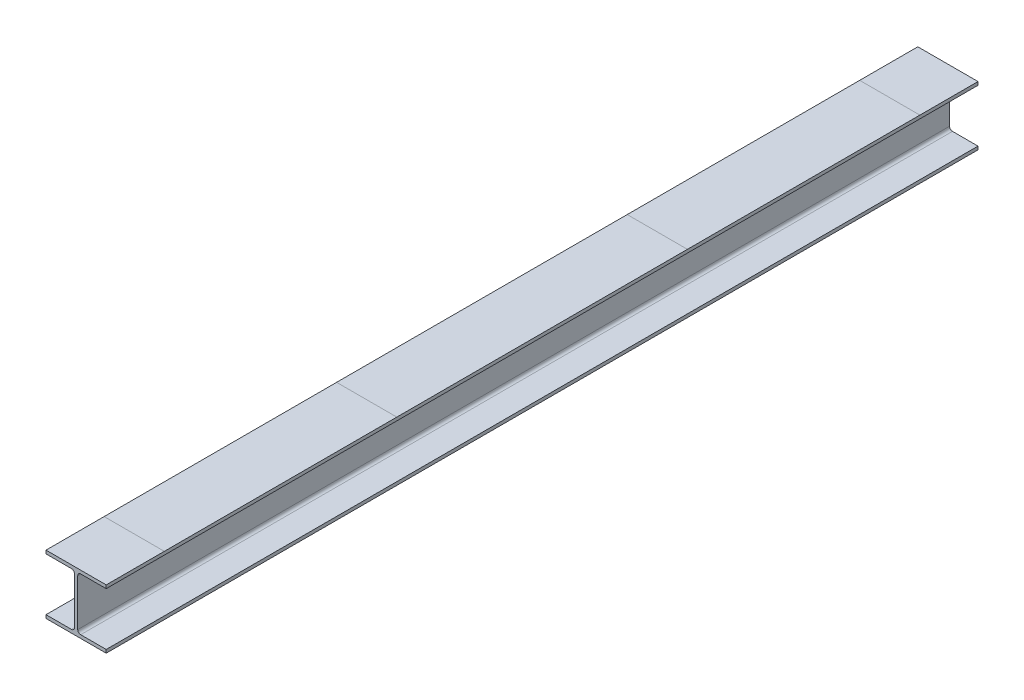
ISO-10303-21;
HEADER;
FILE_DESCRIPTION(('STEP AP214'),'2;1');
FILE_NAME('part.step','',(''),(''),'','','');
FILE_SCHEMA(('AUTOMOTIVE_DESIGN { 1 0 10303 214 1 1 1 1 }'));
ENDSEC;
DATA;
#1=APPLICATION_CONTEXT('core data for automotive mechanical design processes');
#2=APPLICATION_PROTOCOL_DEFINITION('international standard','automotive_design',2000,#1);
#3=PRODUCT_CONTEXT('',#1,'mechanical');
#4=PRODUCT('Part','Part','',(#3));
#5=PRODUCT_RELATED_PRODUCT_CATEGORY('part','',(#4));
#6=PRODUCT_DEFINITION_FORMATION('','',#4);
#7=PRODUCT_DEFINITION_CONTEXT('part definition',#1,'design');
#8=PRODUCT_DEFINITION('design','',#6,#7);
#9=PRODUCT_DEFINITION_SHAPE('','',#8);
#10=(LENGTH_UNIT() NAMED_UNIT(*) SI_UNIT(.MILLI.,.METRE.));
#11=(NAMED_UNIT(*) PLANE_ANGLE_UNIT() SI_UNIT($,.RADIAN.));
#12=(NAMED_UNIT(*) SI_UNIT($,.STERADIAN.) SOLID_ANGLE_UNIT());
#13=UNCERTAINTY_MEASURE_WITH_UNIT(LENGTH_MEASURE(1.E-05),#10,'distance_accuracy_value','');
#14=(GEOMETRIC_REPRESENTATION_CONTEXT(3) GLOBAL_UNCERTAINTY_ASSIGNED_CONTEXT((#13)) GLOBAL_UNIT_ASSIGNED_CONTEXT((#10,
#11,#12)) REPRESENTATION_CONTEXT('',''));
#15=CARTESIAN_POINT('',(0.,0.,0.));
#16=DIRECTION('',(0.,0.,1.));
#17=DIRECTION('',(1.,0.,0.));
#18=AXIS2_PLACEMENT_3D('',#15,#16,#17);
#19=CARTESIAN_POINT('',(-81.2800000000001,194.945,3000.));
#20=DIRECTION('',(0.,-1.,0.));
#21=DIRECTION('',(0.,0.,-1.));
#22=AXIS2_PLACEMENT_3D('',#19,#20,#21);
#23=PLANE('',#22);
#24=DIRECTION('',(-1.,0.,0.));
#25=VECTOR('',#24,1.);
#26=CARTESIAN_POINT('',(-81.2800000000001,194.945,2800.));
#27=LINE('',#26,#25);
#28=CARTESIAN_POINT('',(125.857,194.945,2800.));
#29=VERTEX_POINT('',#28);
#30=CARTESIAN_POINT('',(-81.2800000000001,194.945,2800.));
#31=VERTEX_POINT('',#30);
#32=EDGE_CURVE('E11',#29,#31,#27,.T.);
#33=ORIENTED_EDGE('',*,*,#32,.F.);
#34=DIRECTION('',(0.,0.,-1.));
#35=VECTOR('',#34,1.);
#36=CARTESIAN_POINT('',(125.857,194.945,3000.));
#37=LINE('',#36,#35);
#38=CARTESIAN_POINT('',(125.857,194.945,2000.));
#39=VERTEX_POINT('',#38);
#40=EDGE_CURVE('E237',#29,#39,#37,.T.);
#41=ORIENTED_EDGE('',*,*,#40,.T.);
#42=DIRECTION('',(1.,0.,0.));
#43=VECTOR('',#42,1.);
#44=CARTESIAN_POINT('',(-81.2800000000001,194.945,2000.));
#45=LINE('',#44,#43);
#46=CARTESIAN_POINT('',(-81.2800000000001,194.945,2000.));
#47=VERTEX_POINT('',#46);
#48=EDGE_CURVE('E206',#47,#39,#45,.T.);
#49=ORIENTED_EDGE('',*,*,#48,.F.);
#50=DIRECTION('',(0.,0.,-1.));
#51=VECTOR('',#50,1.);
#52=CARTESIAN_POINT('',(-81.2800000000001,194.945,3000.));
#53=LINE('',#52,#51);
#54=EDGE_CURVE('E243',#31,#47,#53,.T.);
#55=ORIENTED_EDGE('',*,*,#54,.F.);
#56=EDGE_LOOP('',(#33,#41,#49,#55));
#57=FACE_BOUND('',#56,.T.);
#58=ADVANCED_FACE('F34',(#57),#23,.F.);
#59=CARTESIAN_POINT('',(125.857,-8.76299999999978,3000.));
#60=DIRECTION('',(0.,1.,0.));
#61=DIRECTION('',(-1.,0.,0.));
#62=AXIS2_PLACEMENT_3D('',#59,#60,#61);
#63=PLANE('',#62);
#64=DIRECTION('',(1.,0.,0.));
#65=VECTOR('',#64,1.);
#66=CARTESIAN_POINT('',(125.857,-8.76299999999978,1000.));
#67=LINE('',#66,#65);
#68=CARTESIAN_POINT('',(-81.2800000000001,-8.76299999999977,1000.));
#69=VERTEX_POINT('',#68);
#70=CARTESIAN_POINT('',(125.857,-8.76299999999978,1000.));
#71=VERTEX_POINT('',#70);
#72=EDGE_CURVE('E43',#69,#71,#67,.T.);
#73=ORIENTED_EDGE('',*,*,#72,.F.);
#74=DIRECTION('',(0.,0.,-1.));
#75=VECTOR('',#74,1.);
#76=CARTESIAN_POINT('',(-81.2800000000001,-8.76299999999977,3000.));
#77=LINE('',#76,#75);
#78=CARTESIAN_POINT('',(-81.2800000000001,-8.76299999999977,0.));
#79=VERTEX_POINT('',#78);
#80=EDGE_CURVE('E267',#69,#79,#77,.T.);
#81=ORIENTED_EDGE('',*,*,#80,.T.);
#82=DIRECTION('',(1.,0.,0.));
#83=VECTOR('',#82,1.);
#84=CARTESIAN_POINT('',(125.857,-8.76299999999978,0.));
#85=LINE('',#84,#83);
#86=CARTESIAN_POINT('',(125.857,-8.76299999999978,0.));
#87=VERTEX_POINT('',#86);
#88=EDGE_CURVE('E300',#79,#87,#85,.T.);
#89=ORIENTED_EDGE('',*,*,#88,.T.);
#90=DIRECTION('',(0.,0.,-1.));
#91=VECTOR('',#90,1.);
#92=CARTESIAN_POINT('',(125.857,-8.76299999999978,3000.));
#93=LINE('',#92,#91);
#94=EDGE_CURVE('E209',#71,#87,#93,.T.);
#95=ORIENTED_EDGE('',*,*,#94,.F.);
#96=EDGE_LOOP('',(#73,#81,#89,#95));
#97=FACE_BOUND('',#96,.T.);
#98=ADVANCED_FACE('F395',(#97),#63,.F.);
#99=DIRECTION('',(-1.,0.,0.));
#100=VECTOR('',#99,1.);
#101=CARTESIAN_POINT('',(125.857,-8.76299999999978,2000.));
#102=LINE('',#101,#100);
#103=CARTESIAN_POINT('',(125.857,-8.76299999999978,2000.));
#104=VERTEX_POINT('',#103);
#105=CARTESIAN_POINT('',(-81.2800000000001,-8.76299999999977,2000.));
#106=VERTEX_POINT('',#105);
#107=EDGE_CURVE('E204',#104,#106,#102,.T.);
#108=ORIENTED_EDGE('',*,*,#107,.F.);
#109=CARTESIAN_POINT('',(125.857,-8.76299999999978,3000.));
#110=VERTEX_POINT('',#109);
#111=EDGE_CURVE('E186',#110,#104,#93,.T.);
#112=ORIENTED_EDGE('',*,*,#111,.F.);
#113=DIRECTION('',(1.,0.,0.));
#114=VECTOR('',#113,1.);
#115=CARTESIAN_POINT('',(125.857,-8.76299999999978,3000.));
#116=LINE('',#115,#114);
#117=CARTESIAN_POINT('',(-81.2800000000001,-8.76299999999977,3000.));
#118=VERTEX_POINT('',#117);
#119=EDGE_CURVE('E192',#118,#110,#116,.T.);
#120=ORIENTED_EDGE('',*,*,#119,.F.);
#121=EDGE_CURVE('E264',#118,#106,#77,.T.);
#122=ORIENTED_EDGE('',*,*,#121,.T.);
#123=EDGE_LOOP('',(#108,#112,#120,#122));
#124=FACE_BOUND('',#123,.T.);
#125=ADVANCED_FACE('F203',(#124),#63,.F.);
#126=DIRECTION('',(1.,0.,0.));
#127=VECTOR('',#126,1.);
#128=CARTESIAN_POINT('',(-81.2800000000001,194.945,200.));
#129=LINE('',#128,#127);
#130=CARTESIAN_POINT('',(-81.2800000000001,194.945,200.));
#131=VERTEX_POINT('',#130);
#132=CARTESIAN_POINT('',(125.857,194.945,200.));
#133=VERTEX_POINT('',#132);
#134=EDGE_CURVE('E410',#131,#133,#129,.T.);
#135=ORIENTED_EDGE('',*,*,#134,.F.);
#136=CARTESIAN_POINT('',(-81.2800000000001,194.945,1000.));
#137=VERTEX_POINT('',#136);
#138=EDGE_CURVE('E418',#137,#131,#53,.T.);
#139=ORIENTED_EDGE('',*,*,#138,.F.);
#140=DIRECTION('',(-1.,0.,0.));
#141=VECTOR('',#140,1.);
#142=CARTESIAN_POINT('',(-81.2800000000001,194.945,1000.));
#143=LINE('',#142,#141);
#144=CARTESIAN_POINT('',(125.857,194.945,1000.));
#145=VERTEX_POINT('',#144);
#146=EDGE_CURVE('E212',#145,#137,#143,.T.);
#147=ORIENTED_EDGE('',*,*,#146,.F.);
#148=EDGE_CURVE('E404',#145,#133,#37,.T.);
#149=ORIENTED_EDGE('',*,*,#148,.T.);
#150=EDGE_LOOP('',(#135,#139,#147,#149));
#151=FACE_BOUND('',#150,.T.);
#152=ADVANCED_FACE('F408',(#151),#23,.F.);
#153=CARTESIAN_POINT('',(-81.2800000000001,194.945,0.));
#154=VERTEX_POINT('',#153);
#155=EDGE_CURVE('E248',#131,#154,#53,.T.);
#156=ORIENTED_EDGE('',*,*,#155,.F.);
#157=ORIENTED_EDGE('',*,*,#134,.T.);
#158=CARTESIAN_POINT('',(125.857,194.945,0.));
#159=VERTEX_POINT('',#158);
#160=EDGE_CURVE('E242',#133,#159,#37,.T.);
#161=ORIENTED_EDGE('',*,*,#160,.T.);
#162=DIRECTION('',(-1.,0.,0.));
#163=VECTOR('',#162,1.);
#164=CARTESIAN_POINT('',(-81.2800000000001,194.945,0.));
#165=LINE('',#164,#163);
#166=EDGE_CURVE('E282',#159,#154,#165,.T.);
#167=ORIENTED_EDGE('',*,*,#166,.T.);
#168=EDGE_LOOP('',(#156,#157,#161,#167));
#169=FACE_BOUND('',#168,.T.);
#170=ADVANCED_FACE('F419',(#169),#23,.F.);
#171=CARTESIAN_POINT('',(125.857,194.945,3000.));
#172=VERTEX_POINT('',#171);
#173=EDGE_CURVE('E235',#172,#29,#37,.T.);
#174=ORIENTED_EDGE('',*,*,#173,.T.);
#175=ORIENTED_EDGE('',*,*,#32,.T.);
#176=CARTESIAN_POINT('',(-81.2800000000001,194.945,3000.));
#177=VERTEX_POINT('',#176);
#178=EDGE_CURVE('E239',#177,#31,#53,.T.);
#179=ORIENTED_EDGE('',*,*,#178,.F.);
#180=DIRECTION('',(-1.,0.,0.));
#181=VECTOR('',#180,1.);
#182=CARTESIAN_POINT('',(-81.2800000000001,194.945,3000.));
#183=LINE('',#182,#181);
#184=EDGE_CURVE('E316',#172,#177,#183,.T.);
#185=ORIENTED_EDGE('',*,*,#184,.F.);
#186=EDGE_LOOP('',(#174,#175,#179,#185));
#187=FACE_BOUND('',#186,.T.);
#188=ADVANCED_FACE('F358',(#187),#23,.F.);
#189=EDGE_CURVE('E266',#106,#69,#77,.T.);
#190=ORIENTED_EDGE('',*,*,#189,.T.);
#191=ORIENTED_EDGE('',*,*,#72,.T.);
#192=EDGE_CURVE('E207',#104,#71,#93,.T.);
#193=ORIENTED_EDGE('',*,*,#192,.F.);
#194=ORIENTED_EDGE('',*,*,#107,.T.);
#195=EDGE_LOOP('',(#190,#191,#193,#194));
#196=FACE_BOUND('',#195,.T.);
#197=ADVANCED_FACE('F36',(#196),#63,.F.);
#198=CARTESIAN_POINT('',(125.857,2.54000000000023,3000.));
#199=DIRECTION('',(-1.,0.,0.));
#200=DIRECTION('',(0.,-1.,0.));
#201=AXIS2_PLACEMENT_3D('',#198,#199,#200);
#202=PLANE('',#201);
#203=DIRECTION('',(0.,1.,0.));
#204=VECTOR('',#203,1.);
#205=CARTESIAN_POINT('',(125.857,2.54000000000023,0.));
#206=LINE('',#205,#204);
#207=CARTESIAN_POINT('',(125.857,2.54000000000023,0.));
#208=VERTEX_POINT('',#207);
#209=EDGE_CURVE('E298',#87,#208,#206,.T.);
#210=ORIENTED_EDGE('',*,*,#209,.T.);
#211=DIRECTION('',(0.,0.,-1.));
#212=VECTOR('',#211,1.);
#213=CARTESIAN_POINT('',(125.857,2.54000000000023,3000.));
#214=LINE('',#213,#212);
#215=CARTESIAN_POINT('',(125.857,2.54000000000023,3000.));
#216=VERTEX_POINT('',#215);
#217=EDGE_CURVE('E188',#216,#208,#214,.T.);
#218=ORIENTED_EDGE('',*,*,#217,.F.);
#219=DIRECTION('',(0.,1.,0.));
#220=VECTOR('',#219,1.);
#221=CARTESIAN_POINT('',(125.857,2.54000000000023,3000.));
#222=LINE('',#221,#220);
#223=EDGE_CURVE('E181',#110,#216,#222,.T.);
#224=ORIENTED_EDGE('',*,*,#223,.F.);
#225=ORIENTED_EDGE('',*,*,#111,.T.);
#226=ORIENTED_EDGE('',*,*,#192,.T.);
#227=ORIENTED_EDGE('',*,*,#94,.T.);
#228=EDGE_LOOP('',(#210,#218,#224,#225,#226,#227));
#229=FACE_BOUND('',#228,.T.);
#230=ADVANCED_FACE('F183',(#229),#202,.F.);
#231=CARTESIAN_POINT('',(38.0999999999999,2.54000000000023,3000.));
#232=DIRECTION('',(0.,-1.,0.));
#233=DIRECTION('',(0.,0.,-1.));
#234=AXIS2_PLACEMENT_3D('',#231,#232,#233);
#235=PLANE('',#234);
#236=DIRECTION('',(-1.,0.,0.));
#237=VECTOR('',#236,1.);
#238=CARTESIAN_POINT('',(38.0999999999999,2.54000000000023,0.));
#239=LINE('',#238,#237);
#240=CARTESIAN_POINT('',(38.0999999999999,2.54000000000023,0.));
#241=VERTEX_POINT('',#240);
#242=EDGE_CURVE('E296',#208,#241,#239,.T.);
#243=ORIENTED_EDGE('',*,*,#242,.T.);
#244=DIRECTION('',(0.,0.,-1.));
#245=VECTOR('',#244,1.);
#246=CARTESIAN_POINT('',(38.0999999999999,2.54000000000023,3000.));
#247=LINE('',#246,#245);
#248=CARTESIAN_POINT('',(38.0999999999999,2.54000000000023,3000.));
#249=VERTEX_POINT('',#248);
#250=EDGE_CURVE('E217',#249,#241,#247,.T.);
#251=ORIENTED_EDGE('',*,*,#250,.F.);
#252=DIRECTION('',(-1.,0.,0.));
#253=VECTOR('',#252,1.);
#254=CARTESIAN_POINT('',(38.0999999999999,2.54000000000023,3000.));
#255=LINE('',#254,#253);
#256=EDGE_CURVE('E191',#216,#249,#255,.T.);
#257=ORIENTED_EDGE('',*,*,#256,.F.);
#258=ORIENTED_EDGE('',*,*,#217,.T.);
#259=EDGE_LOOP('',(#243,#251,#257,#258));
#260=FACE_BOUND('',#259,.T.);
#261=ADVANCED_FACE('F331',(#260),#235,.F.);
#262=CARTESIAN_POINT('',(38.0999999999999,12.7000000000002,3000.));
#263=DIRECTION('',(0.,0.,-1.));
#264=DIRECTION('',(-1.,0.,0.));
#265=AXIS2_PLACEMENT_3D('',#262,#263,#264);
#266=CYLINDRICAL_SURFACE('',#265,10.16);
#267=CARTESIAN_POINT('',(38.0999999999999,12.7000000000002,0.));
#268=DIRECTION('',(0.,0.,-1.));
#269=DIRECTION('',(1.,0.,0.));
#270=AXIS2_PLACEMENT_3D('',#267,#268,#269);
#271=CIRCLE('',#270,10.16);
#272=CARTESIAN_POINT('',(27.9399999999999,12.7000000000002,0.));
#273=VERTEX_POINT('',#272);
#274=EDGE_CURVE('E294',#241,#273,#271,.T.);
#275=ORIENTED_EDGE('',*,*,#274,.T.);
#276=DIRECTION('',(0.,0.,-1.));
#277=VECTOR('',#276,1.);
#278=CARTESIAN_POINT('',(27.9399999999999,12.7000000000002,3000.));
#279=LINE('',#278,#277);
#280=CARTESIAN_POINT('',(27.9399999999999,12.7000000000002,3000.));
#281=VERTEX_POINT('',#280);
#282=EDGE_CURVE('E221',#281,#273,#279,.T.);
#283=ORIENTED_EDGE('',*,*,#282,.F.);
#284=CARTESIAN_POINT('',(38.0999999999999,12.7000000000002,3000.));
#285=DIRECTION('',(0.,0.,-1.));
#286=DIRECTION('',(1.,0.,0.));
#287=AXIS2_PLACEMENT_3D('',#284,#285,#286);
#288=CIRCLE('',#287,10.16);
#289=EDGE_CURVE('E326',#249,#281,#288,.T.);
#290=ORIENTED_EDGE('',*,*,#289,.F.);
#291=ORIENTED_EDGE('',*,*,#250,.T.);
#292=EDGE_LOOP('',(#275,#283,#290,#291));
#293=FACE_BOUND('',#292,.T.);
#294=ADVANCED_FACE('F334',(#293),#266,.F.);
#295=CARTESIAN_POINT('',(27.9399999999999,173.482,3000.));
#296=DIRECTION('',(-1.,0.,0.));
#297=DIRECTION('',(0.,-1.,0.));
#298=AXIS2_PLACEMENT_3D('',#295,#296,#297);
#299=PLANE('',#298);
#300=DIRECTION('',(0.,1.,0.));
#301=VECTOR('',#300,1.);
#302=CARTESIAN_POINT('',(27.9399999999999,173.482,0.));
#303=LINE('',#302,#301);
#304=CARTESIAN_POINT('',(27.9399999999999,173.482,0.));
#305=VERTEX_POINT('',#304);
#306=EDGE_CURVE('E292',#273,#305,#303,.T.);
#307=ORIENTED_EDGE('',*,*,#306,.T.);
#308=DIRECTION('',(0.,0.,-1.));
#309=VECTOR('',#308,1.);
#310=CARTESIAN_POINT('',(27.9399999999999,173.482,3000.));
#311=LINE('',#310,#309);
#312=CARTESIAN_POINT('',(27.9399999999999,173.482,3000.));
#313=VERTEX_POINT('',#312);
#314=EDGE_CURVE('E226',#313,#305,#311,.T.);
#315=ORIENTED_EDGE('',*,*,#314,.F.);
#316=DIRECTION('',(0.,1.,0.));
#317=VECTOR('',#316,1.);
#318=CARTESIAN_POINT('',(27.9399999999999,173.482,3000.));
#319=LINE('',#318,#317);
#320=EDGE_CURVE('E324',#281,#313,#319,.T.);
#321=ORIENTED_EDGE('',*,*,#320,.F.);
#322=ORIENTED_EDGE('',*,*,#282,.T.);
#323=EDGE_LOOP('',(#307,#315,#321,#322));
#324=FACE_BOUND('',#323,.T.);
#325=ADVANCED_FACE('F339',(#324),#299,.F.);
#326=CARTESIAN_POINT('',(38.0999999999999,173.482,3000.));
#327=DIRECTION('',(0.,0.,-1.));
#328=DIRECTION('',(-1.,0.,0.));
#329=AXIS2_PLACEMENT_3D('',#326,#327,#328);
#330=CYLINDRICAL_SURFACE('',#329,10.16);
#331=CARTESIAN_POINT('',(38.0999999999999,173.482,0.));
#332=DIRECTION('',(0.,0.,-1.));
#333=DIRECTION('',(1.,0.,0.));
#334=AXIS2_PLACEMENT_3D('',#331,#332,#333);
#335=CIRCLE('',#334,10.16);
#336=CARTESIAN_POINT('',(38.0999999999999,183.642,0.));
#337=VERTEX_POINT('',#336);
#338=EDGE_CURVE('E290',#305,#337,#335,.T.);
#339=ORIENTED_EDGE('',*,*,#338,.T.);
#340=DIRECTION('',(0.,0.,-1.));
#341=VECTOR('',#340,1.);
#342=CARTESIAN_POINT('',(38.0999999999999,183.642,3000.));
#343=LINE('',#342,#341);
#344=CARTESIAN_POINT('',(38.0999999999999,183.642,3000.));
#345=VERTEX_POINT('',#344);
#346=EDGE_CURVE('E229',#345,#337,#343,.T.);
#347=ORIENTED_EDGE('',*,*,#346,.F.);
#348=CARTESIAN_POINT('',(38.0999999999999,173.482,3000.));
#349=DIRECTION('',(0.,0.,-1.));
#350=DIRECTION('',(1.,0.,0.));
#351=AXIS2_PLACEMENT_3D('',#348,#349,#350);
#352=CIRCLE('',#351,10.16);
#353=EDGE_CURVE('E322',#313,#345,#352,.T.);
#354=ORIENTED_EDGE('',*,*,#353,.F.);
#355=ORIENTED_EDGE('',*,*,#314,.T.);
#356=EDGE_LOOP('',(#339,#347,#354,#355));
#357=FACE_BOUND('',#356,.T.);
#358=ADVANCED_FACE('F345',(#357),#330,.F.);
#359=CARTESIAN_POINT('',(125.857,183.642,3000.));
#360=DIRECTION('',(0.,1.,0.));
#361=DIRECTION('',(0.,0.,1.));
#362=AXIS2_PLACEMENT_3D('',#359,#360,#361);
#363=PLANE('',#362);
#364=DIRECTION('',(1.,0.,0.));
#365=VECTOR('',#364,1.);
#366=CARTESIAN_POINT('',(125.857,183.642,0.));
#367=LINE('',#366,#365);
#368=CARTESIAN_POINT('',(125.857,183.642,0.));
#369=VERTEX_POINT('',#368);
#370=EDGE_CURVE('E288',#337,#369,#367,.T.);
#371=ORIENTED_EDGE('',*,*,#370,.T.);
#372=DIRECTION('',(0.,0.,-1.));
#373=VECTOR('',#372,1.);
#374=CARTESIAN_POINT('',(125.857,183.642,3000.));
#375=LINE('',#374,#373);
#376=CARTESIAN_POINT('',(125.857,183.642,3000.));
#377=VERTEX_POINT('',#376);
#378=EDGE_CURVE('E232',#377,#369,#375,.T.);
#379=ORIENTED_EDGE('',*,*,#378,.F.);
#380=DIRECTION('',(1.,0.,0.));
#381=VECTOR('',#380,1.);
#382=CARTESIAN_POINT('',(125.857,183.642,3000.));
#383=LINE('',#382,#381);
#384=EDGE_CURVE('E320',#345,#377,#383,.T.);
#385=ORIENTED_EDGE('',*,*,#384,.F.);
#386=ORIENTED_EDGE('',*,*,#346,.T.);
#387=EDGE_LOOP('',(#371,#379,#385,#386));
#388=FACE_BOUND('',#387,.T.);
#389=ADVANCED_FACE('F349',(#388),#363,.F.);
#390=CARTESIAN_POINT('',(125.857,194.945,3000.));
#391=DIRECTION('',(-1.,0.,0.));
#392=DIRECTION('',(0.,-1.,0.));
#393=AXIS2_PLACEMENT_3D('',#390,#391,#392);
#394=PLANE('',#393);
#395=DIRECTION('',(0.,1.,0.));
#396=VECTOR('',#395,1.);
#397=CARTESIAN_POINT('',(125.857,194.945,0.));
#398=LINE('',#397,#396);
#399=EDGE_CURVE('E285',#369,#159,#398,.T.);
#400=ORIENTED_EDGE('',*,*,#399,.T.);
#401=ORIENTED_EDGE('',*,*,#160,.F.);
#402=ORIENTED_EDGE('',*,*,#148,.F.);
#403=EDGE_CURVE('E238',#39,#145,#37,.T.);
#404=ORIENTED_EDGE('',*,*,#403,.F.);
#405=ORIENTED_EDGE('',*,*,#40,.F.);
#406=ORIENTED_EDGE('',*,*,#173,.F.);
#407=DIRECTION('',(0.,1.,0.));
#408=VECTOR('',#407,1.);
#409=CARTESIAN_POINT('',(125.857,194.945,3000.));
#410=LINE('',#409,#408);
#411=EDGE_CURVE('E318',#377,#172,#410,.T.);
#412=ORIENTED_EDGE('',*,*,#411,.F.);
#413=ORIENTED_EDGE('',*,*,#378,.T.);
#414=EDGE_LOOP('',(#400,#401,#402,#404,#405,#406,#412,#413));
#415=FACE_BOUND('',#414,.T.);
#416=ADVANCED_FACE('F354',(#415),#394,.F.);
#417=ORIENTED_EDGE('',*,*,#403,.T.);
#418=ORIENTED_EDGE('',*,*,#146,.T.);
#419=EDGE_CURVE('E244',#47,#137,#53,.T.);
#420=ORIENTED_EDGE('',*,*,#419,.F.);
#421=ORIENTED_EDGE('',*,*,#48,.T.);
#422=EDGE_LOOP('',(#417,#418,#420,#421));
#423=FACE_BOUND('',#422,.T.);
#424=ADVANCED_FACE('F415',(#423),#23,.F.);
#425=CARTESIAN_POINT('',(-81.2800000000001,183.642,3000.));
#426=DIRECTION('',(1.,0.,0.));
#427=DIRECTION('',(0.,0.,-1.));
#428=AXIS2_PLACEMENT_3D('',#425,#426,#427);
#429=PLANE('',#428);
#430=DIRECTION('',(0.,-1.,0.));
#431=VECTOR('',#430,1.);
#432=CARTESIAN_POINT('',(-81.2800000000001,183.642,0.));
#433=LINE('',#432,#431);
#434=CARTESIAN_POINT('',(-81.2800000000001,183.642,0.));
#435=VERTEX_POINT('',#434);
#436=EDGE_CURVE('E280',#154,#435,#433,.T.);
#437=ORIENTED_EDGE('',*,*,#436,.T.);
#438=DIRECTION('',(0.,0.,-1.));
#439=VECTOR('',#438,1.);
#440=CARTESIAN_POINT('',(-81.2800000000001,183.642,3000.));
#441=LINE('',#440,#439);
#442=CARTESIAN_POINT('',(-81.2800000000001,183.642,3000.));
#443=VERTEX_POINT('',#442);
#444=EDGE_CURVE('E245',#443,#435,#441,.T.);
#445=ORIENTED_EDGE('',*,*,#444,.F.);
#446=DIRECTION('',(0.,-1.,0.));
#447=VECTOR('',#446,1.);
#448=CARTESIAN_POINT('',(-81.2800000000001,183.642,3000.));
#449=LINE('',#448,#447);
#450=EDGE_CURVE('E314',#177,#443,#449,.T.);
#451=ORIENTED_EDGE('',*,*,#450,.F.);
#452=ORIENTED_EDGE('',*,*,#178,.T.);
#453=ORIENTED_EDGE('',*,*,#54,.T.);
#454=ORIENTED_EDGE('',*,*,#419,.T.);
#455=ORIENTED_EDGE('',*,*,#138,.T.);
#456=ORIENTED_EDGE('',*,*,#155,.T.);
#457=EDGE_LOOP('',(#437,#445,#451,#452,#453,#454,#455,#456));
#458=FACE_BOUND('',#457,.T.);
#459=ADVANCED_FACE('F360',(#458),#429,.F.);
#460=CARTESIAN_POINT('',(6.47699999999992,183.642,3000.));
#461=DIRECTION('',(0.,1.,0.));
#462=DIRECTION('',(0.,0.,1.));
#463=AXIS2_PLACEMENT_3D('',#460,#461,#462);
#464=PLANE('',#463);
#465=DIRECTION('',(1.,0.,0.));
#466=VECTOR('',#465,1.);
#467=CARTESIAN_POINT('',(6.47699999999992,183.642,0.));
#468=LINE('',#467,#466);
#469=CARTESIAN_POINT('',(6.47699999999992,183.642,0.));
#470=VERTEX_POINT('',#469);
#471=EDGE_CURVE('E278',#435,#470,#468,.T.);
#472=ORIENTED_EDGE('',*,*,#471,.T.);
#473=DIRECTION('',(0.,0.,-1.));
#474=VECTOR('',#473,1.);
#475=CARTESIAN_POINT('',(6.47699999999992,183.642,3000.));
#476=LINE('',#475,#474);
#477=CARTESIAN_POINT('',(6.47699999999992,183.642,3000.));
#478=VERTEX_POINT('',#477);
#479=EDGE_CURVE('E249',#478,#470,#476,.T.);
#480=ORIENTED_EDGE('',*,*,#479,.F.);
#481=DIRECTION('',(1.,0.,0.));
#482=VECTOR('',#481,1.);
#483=CARTESIAN_POINT('',(6.47699999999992,183.642,3000.));
#484=LINE('',#483,#482);
#485=EDGE_CURVE('E312',#443,#478,#484,.T.);
#486=ORIENTED_EDGE('',*,*,#485,.F.);
#487=ORIENTED_EDGE('',*,*,#444,.T.);
#488=EDGE_LOOP('',(#472,#480,#486,#487));
#489=FACE_BOUND('',#488,.T.);
#490=ADVANCED_FACE('F366',(#489),#464,.F.);
#491=CARTESIAN_POINT('',(6.47699999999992,173.482,3000.));
#492=DIRECTION('',(0.,0.,-1.));
#493=DIRECTION('',(-1.,0.,0.));
#494=AXIS2_PLACEMENT_3D('',#491,#492,#493);
#495=CYLINDRICAL_SURFACE('',#494,10.16);
#496=CARTESIAN_POINT('',(6.47699999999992,173.482,0.));
#497=DIRECTION('',(0.,0.,-1.));
#498=DIRECTION('',(1.,0.,0.));
#499=AXIS2_PLACEMENT_3D('',#496,#497,#498);
#500=CIRCLE('',#499,10.16);
#501=CARTESIAN_POINT('',(16.6369999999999,173.482,0.));
#502=VERTEX_POINT('',#501);
#503=EDGE_CURVE('E276',#470,#502,#500,.T.);
#504=ORIENTED_EDGE('',*,*,#503,.T.);
#505=DIRECTION('',(0.,0.,-1.));
#506=VECTOR('',#505,1.);
#507=CARTESIAN_POINT('',(16.6369999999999,173.482,3000.));
#508=LINE('',#507,#506);
#509=CARTESIAN_POINT('',(16.6369999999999,173.482,3000.));
#510=VERTEX_POINT('',#509);
#511=EDGE_CURVE('E252',#510,#502,#508,.T.);
#512=ORIENTED_EDGE('',*,*,#511,.F.);
#513=CARTESIAN_POINT('',(6.47699999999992,173.482,3000.));
#514=DIRECTION('',(0.,0.,-1.));
#515=DIRECTION('',(1.,0.,0.));
#516=AXIS2_PLACEMENT_3D('',#513,#514,#515);
#517=CIRCLE('',#516,10.16);
#518=EDGE_CURVE('E310',#478,#510,#517,.T.);
#519=ORIENTED_EDGE('',*,*,#518,.F.);
#520=ORIENTED_EDGE('',*,*,#479,.T.);
#521=EDGE_LOOP('',(#504,#512,#519,#520));
#522=FACE_BOUND('',#521,.T.);
#523=ADVANCED_FACE('F372',(#522),#495,.F.);
#524=CARTESIAN_POINT('',(16.6369999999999,12.7000000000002,3000.));
#525=DIRECTION('',(1.,0.,0.));
#526=DIRECTION('',(0.,1.,0.));
#527=AXIS2_PLACEMENT_3D('',#524,#525,#526);
#528=PLANE('',#527);
#529=DIRECTION('',(0.,-1.,0.));
#530=VECTOR('',#529,1.);
#531=CARTESIAN_POINT('',(16.6369999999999,12.7000000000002,0.));
#532=LINE('',#531,#530);
#533=CARTESIAN_POINT('',(16.6369999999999,12.7000000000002,0.));
#534=VERTEX_POINT('',#533);
#535=EDGE_CURVE('E274',#502,#534,#532,.T.);
#536=ORIENTED_EDGE('',*,*,#535,.T.);
#537=DIRECTION('',(0.,0.,-1.));
#538=VECTOR('',#537,1.);
#539=CARTESIAN_POINT('',(16.6369999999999,12.7000000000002,3000.));
#540=LINE('',#539,#538);
#541=CARTESIAN_POINT('',(16.6369999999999,12.7000000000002,3000.));
#542=VERTEX_POINT('',#541);
#543=EDGE_CURVE('E255',#542,#534,#540,.T.);
#544=ORIENTED_EDGE('',*,*,#543,.F.);
#545=DIRECTION('',(0.,-1.,0.));
#546=VECTOR('',#545,1.);
#547=CARTESIAN_POINT('',(16.6369999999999,12.7000000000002,3000.));
#548=LINE('',#547,#546);
#549=EDGE_CURVE('E308',#510,#542,#548,.T.);
#550=ORIENTED_EDGE('',*,*,#549,.F.);
#551=ORIENTED_EDGE('',*,*,#511,.T.);
#552=EDGE_LOOP('',(#536,#544,#550,#551));
#553=FACE_BOUND('',#552,.T.);
#554=ADVANCED_FACE('F376',(#553),#528,.F.);
#555=CARTESIAN_POINT('',(6.47699999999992,12.7000000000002,3000.));
#556=DIRECTION('',(0.,0.,-1.));
#557=DIRECTION('',(-1.,0.,0.));
#558=AXIS2_PLACEMENT_3D('',#555,#556,#557);
#559=CYLINDRICAL_SURFACE('',#558,10.16);
#560=CARTESIAN_POINT('',(6.47699999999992,12.7000000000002,0.));
#561=DIRECTION('',(0.,0.,-1.));
#562=DIRECTION('',(1.,0.,0.));
#563=AXIS2_PLACEMENT_3D('',#560,#561,#562);
#564=CIRCLE('',#563,10.16);
#565=CARTESIAN_POINT('',(6.47699999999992,2.54000000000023,0.));
#566=VERTEX_POINT('',#565);
#567=EDGE_CURVE('E272',#534,#566,#564,.T.);
#568=ORIENTED_EDGE('',*,*,#567,.T.);
#569=DIRECTION('',(0.,0.,-1.));
#570=VECTOR('',#569,1.);
#571=CARTESIAN_POINT('',(6.47699999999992,2.54000000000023,3000.));
#572=LINE('',#571,#570);
#573=CARTESIAN_POINT('',(6.47699999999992,2.54000000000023,3000.));
#574=VERTEX_POINT('',#573);
#575=EDGE_CURVE('E258',#574,#566,#572,.T.);
#576=ORIENTED_EDGE('',*,*,#575,.F.);
#577=CARTESIAN_POINT('',(6.47699999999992,12.7000000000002,3000.));
#578=DIRECTION('',(0.,0.,-1.));
#579=DIRECTION('',(1.,0.,0.));
#580=AXIS2_PLACEMENT_3D('',#577,#578,#579);
#581=CIRCLE('',#580,10.16);
#582=EDGE_CURVE('E306',#542,#574,#581,.T.);
#583=ORIENTED_EDGE('',*,*,#582,.F.);
#584=ORIENTED_EDGE('',*,*,#543,.T.);
#585=EDGE_LOOP('',(#568,#576,#583,#584));
#586=FACE_BOUND('',#585,.T.);
#587=ADVANCED_FACE('F381',(#586),#559,.F.);
#588=CARTESIAN_POINT('',(-81.2800000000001,2.54000000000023,3000.));
#589=DIRECTION('',(0.,-1.,0.));
#590=DIRECTION('',(1.,0.,0.));
#591=AXIS2_PLACEMENT_3D('',#588,#589,#590);
#592=PLANE('',#591);
#593=DIRECTION('',(-1.,0.,0.));
#594=VECTOR('',#593,1.);
#595=CARTESIAN_POINT('',(-81.2800000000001,2.54000000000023,0.));
#596=LINE('',#595,#594);
#597=CARTESIAN_POINT('',(-81.2800000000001,2.54000000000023,0.));
#598=VERTEX_POINT('',#597);
#599=EDGE_CURVE('E270',#566,#598,#596,.T.);
#600=ORIENTED_EDGE('',*,*,#599,.T.);
#601=DIRECTION('',(0.,0.,-1.));
#602=VECTOR('',#601,1.);
#603=CARTESIAN_POINT('',(-81.2800000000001,2.54000000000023,3000.));
#604=LINE('',#603,#602);
#605=CARTESIAN_POINT('',(-81.2800000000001,2.54000000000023,3000.));
#606=VERTEX_POINT('',#605);
#607=EDGE_CURVE('E261',#606,#598,#604,.T.);
#608=ORIENTED_EDGE('',*,*,#607,.F.);
#609=DIRECTION('',(-1.,0.,0.));
#610=VECTOR('',#609,1.);
#611=CARTESIAN_POINT('',(-81.2800000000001,2.54000000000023,3000.));
#612=LINE('',#611,#610);
#613=EDGE_CURVE('E304',#574,#606,#612,.T.);
#614=ORIENTED_EDGE('',*,*,#613,.F.);
#615=ORIENTED_EDGE('',*,*,#575,.T.);
#616=EDGE_LOOP('',(#600,#608,#614,#615));
#617=FACE_BOUND('',#616,.T.);
#618=ADVANCED_FACE('F385',(#617),#592,.F.);
#619=CARTESIAN_POINT('',(-81.2800000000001,-8.76299999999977,3000.));
#620=DIRECTION('',(1.,0.,0.));
#621=DIRECTION('',(0.,0.,-1.));
#622=AXIS2_PLACEMENT_3D('',#619,#620,#621);
#623=PLANE('',#622);
#624=DIRECTION('',(0.,-1.,0.));
#625=VECTOR('',#624,1.);
#626=CARTESIAN_POINT('',(-81.2800000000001,-8.76299999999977,0.));
#627=LINE('',#626,#625);
#628=EDGE_CURVE('E201',#598,#79,#627,.T.);
#629=ORIENTED_EDGE('',*,*,#628,.T.);
#630=ORIENTED_EDGE('',*,*,#80,.F.);
#631=ORIENTED_EDGE('',*,*,#189,.F.);
#632=ORIENTED_EDGE('',*,*,#121,.F.);
#633=DIRECTION('',(0.,-1.,0.));
#634=VECTOR('',#633,1.);
#635=CARTESIAN_POINT('',(-81.2800000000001,-8.76299999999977,3000.));
#636=LINE('',#635,#634);
#637=EDGE_CURVE('E197',#606,#118,#636,.T.);
#638=ORIENTED_EDGE('',*,*,#637,.F.);
#639=ORIENTED_EDGE('',*,*,#607,.T.);
#640=EDGE_LOOP('',(#629,#630,#631,#632,#638,#639));
#641=FACE_BOUND('',#640,.T.);
#642=ADVANCED_FACE('F389',(#641),#623,.F.);
#643=CARTESIAN_POINT('',(6.47699999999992,12.7000000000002,3000.));
#644=DIRECTION('',(0.,0.,1.));
#645=DIRECTION('',(1.,0.,0.));
#646=AXIS2_PLACEMENT_3D('',#643,#644,#645);
#647=PLANE('',#646);
#648=ORIENTED_EDGE('',*,*,#119,.T.);
#649=ORIENTED_EDGE('',*,*,#223,.T.);
#650=ORIENTED_EDGE('',*,*,#256,.T.);
#651=ORIENTED_EDGE('',*,*,#289,.T.);
#652=ORIENTED_EDGE('',*,*,#320,.T.);
#653=ORIENTED_EDGE('',*,*,#353,.T.);
#654=ORIENTED_EDGE('',*,*,#384,.T.);
#655=ORIENTED_EDGE('',*,*,#411,.T.);
#656=ORIENTED_EDGE('',*,*,#184,.T.);
#657=ORIENTED_EDGE('',*,*,#450,.T.);
#658=ORIENTED_EDGE('',*,*,#485,.T.);
#659=ORIENTED_EDGE('',*,*,#518,.T.);
#660=ORIENTED_EDGE('',*,*,#549,.T.);
#661=ORIENTED_EDGE('',*,*,#582,.T.);
#662=ORIENTED_EDGE('',*,*,#613,.T.);
#663=ORIENTED_EDGE('',*,*,#637,.T.);
#664=EDGE_LOOP('',(#648,#649,#650,#651,#652,#653,#654,#655,#656,#657,#658,#659,#660,#661,#662,#663));
#665=FACE_BOUND('',#664,.T.);
#666=ADVANCED_FACE('F195',(#665),#647,.T.);
#667=CARTESIAN_POINT('',(6.47699999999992,12.7000000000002,0.));
#668=DIRECTION('',(0.,0.,1.));
#669=DIRECTION('',(1.,0.,0.));
#670=AXIS2_PLACEMENT_3D('',#667,#668,#669);
#671=PLANE('',#670);
#672=ORIENTED_EDGE('',*,*,#88,.F.);
#673=ORIENTED_EDGE('',*,*,#628,.F.);
#674=ORIENTED_EDGE('',*,*,#599,.F.);
#675=ORIENTED_EDGE('',*,*,#567,.F.);
#676=ORIENTED_EDGE('',*,*,#535,.F.);
#677=ORIENTED_EDGE('',*,*,#503,.F.);
#678=ORIENTED_EDGE('',*,*,#471,.F.);
#679=ORIENTED_EDGE('',*,*,#436,.F.);
#680=ORIENTED_EDGE('',*,*,#166,.F.);
#681=ORIENTED_EDGE('',*,*,#399,.F.);
#682=ORIENTED_EDGE('',*,*,#370,.F.);
#683=ORIENTED_EDGE('',*,*,#338,.F.);
#684=ORIENTED_EDGE('',*,*,#306,.F.);
#685=ORIENTED_EDGE('',*,*,#274,.F.);
#686=ORIENTED_EDGE('',*,*,#242,.F.);
#687=ORIENTED_EDGE('',*,*,#209,.F.);
#688=EDGE_LOOP('',(#672,#673,#674,#675,#676,#677,#678,#679,#680,#681,#682,#683,#684,#685,#686,#687));
#689=FACE_BOUND('',#688,.T.);
#690=ADVANCED_FACE('F398',(#689),#671,.F.);
#691=CLOSED_SHELL('',(#58,#98,#125,#152,#170,#188,#197,#230,#261,#294,#325,#358,#389,#416,#424,
#459,#490,#523,#554,#587,#618,#642,#666,#690));
#692=MANIFOLD_SOLID_BREP('B2',#691);
#693=ADVANCED_BREP_SHAPE_REPRESENTATION('',(#18,#692),#14);
#694=SHAPE_DEFINITION_REPRESENTATION(#9,#693);
ENDSEC;
END-ISO-10303-21;
